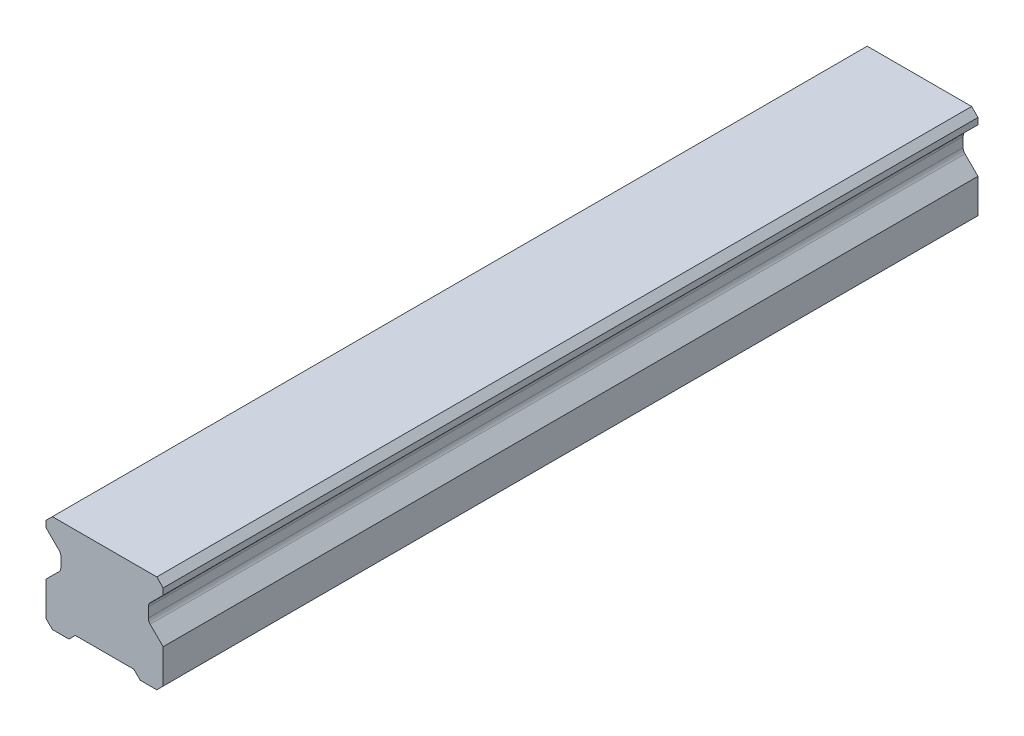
from build123d import *

# Parameters (mm, degrees)
SKETCH1_W           = 23
SKETCH1_H           = 19.2
BOSS_EXTRUDE1_DEPTH = 80
CUT_EXTRUDE1_DEPTH  = 162.557698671
CHAMFER1_SIZE       = 1.25
FILLET1_R           = 1.25
CUT_EXTRUDE2_DEPTH  = 162.557698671


with BuildPart() as part:
    # Sketch1 → Boss-Extrude1 (new, symmetric)
    with BuildSketch(Plane.XY):
        with Locations((0, 9.6)):
            Rectangle(SKETCH1_W, SKETCH1_H)
    extrude(amount=BOSS_EXTRUDE1_DEPTH, both=True)

    # Sketch2 → Cut-Extrude1 (cut, through all)
    with BuildSketch(Plane.XY.offset(80)):
        Polygon((-11.5, 16.7), (-11.5, 7.95), (-8.583333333, 10.866666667), (-8.583333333, 13.783333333), align=None)
        Polygon((8.583333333, 13.783333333), (11.5, 16.7), (11.5, 7.95), (8.583333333, 10.866666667), align=None)
    extrude(amount=-CUT_EXTRUDE1_DEPTH, mode=Mode.SUBTRACT)

    # Chamfer1
    chamfer1_edges = [part.edges().sort_by_distance(p)[0] for p in [
        (-11.5, 19.2, 0),
        (11.5, 19.2, 0),
        (11.5, 0, 0),
        (-11.5, 0, 0),
    ]]
    chamfer(chamfer1_edges, length=CHAMFER1_SIZE)

    # Fillet1
    fillet1_edges = [part.edges().sort_by_distance(p)[0] for p in [
        (-8.583333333, 13.783333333, 0),
        (-8.583333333, 10.866666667, 0),
        (8.583333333, 10.866666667, 0),
        (8.583333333, 13.783333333, 0),
    ]]
    fillet(fillet1_edges, radius=FILLET1_R)

    # Sketch3 → Cut-Extrude2 (cut, through all)
    with BuildSketch(Plane.XY.offset(80)):
        Polygon((-7, 0), (-5.75, 1.25), (5.75, 1.25), (7, 0), align=None)
    extrude(amount=-CUT_EXTRUDE2_DEPTH, mode=Mode.SUBTRACT)


solid = part.part
